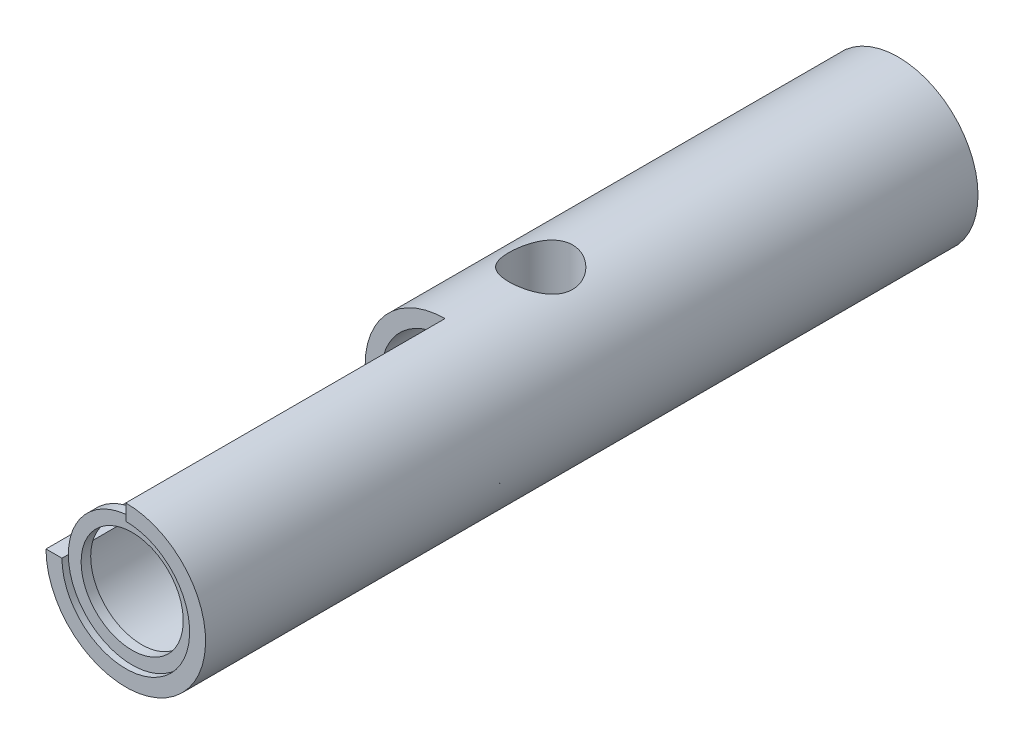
from build123d import *

# Parameters (mm, degrees)
ESQUISSE1_R                  = 12.5
BASE_EXTRUSION_DEPTH         = 121
ESQUISSE2_R                  = 10
ENL_V_MAT_EXTRU_1_DEPTH      = 58
ESQUISSE3_R                  = 4
ENL_V_MAT_EXTRU_2_DEPTH      = 66.433172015
ENL_V_MAT_EXTRU_3_DEPTH      = 15
ENL_V_MAT_EXTRU_3_DEPTH_BACK = 8
ESQUISSE4_R                  = 5
ESQUISSE5_R                  = 3
ENL_V_MAT_EXTRU_4_DEPTH      = 124.35923164
ESQUISSE9_W                  = 55
ESQUISSE9_H                  = 32.337681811
ENL_V_MAT_EXTRU_6_DEPTH      = 123.284504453
ESQUISSE6_W                  = 1.5
ESQUISSE6_H                  = 2


with BuildPart() as part:
    # Esquisse1 → Base-Extrusion (new body)
    with BuildSketch(Plane.XY):
        with Locations(Location((0, 0, 0), (0, 0, 180))):
            Circle(ESQUISSE1_R)
    extrude(amount=BASE_EXTRUSION_DEPTH)

    # Esquisse2 → Enl_v. mat.-Extru.1 (cut)
    with BuildSketch(Plane.XY.offset(121)):
        Circle(ESQUISSE2_R)
    extrude(amount=-ENL_V_MAT_EXTRU_1_DEPTH, mode=Mode.SUBTRACT)

    # Esquisse3 → Enl_v. mat.-Extru.2 (cut, through all)
    with BuildSketch(Plane.XY.offset(63)):
        Circle(ESQUISSE3_R)
    extrude(amount=-ENL_V_MAT_EXTRU_2_DEPTH, mode=Mode.SUBTRACT)

    # Esquisse4 → Enl_v. mat.-Extru.3 (cut, two sides: drawn at the far end of the back side and taken through both)
    with BuildSketch(Plane(origin=(0, 0, 0), x_dir=(-1, 0, 0), z_dir=(0, 1, 0)).offset(-ENL_V_MAT_EXTRU_3_DEPTH_BACK)):
        with Locations(Location((0, 56, 0), (0, 0, 90))):
            Circle(ESQUISSE4_R)
    extrude(amount=ENL_V_MAT_EXTRU_3_DEPTH + ENL_V_MAT_EXTRU_3_DEPTH_BACK, mode=Mode.SUBTRACT)

    # Esquisse5 → Enl_v. mat.-Extru.4 (cut, through all)
    with BuildSketch(Plane(origin=(0, -8, 0), x_dir=(-1, 0, 0), z_dir=(0, 1, 0))):
        with Locations(Location((0, 56, 0), (0, 0, 90))):
            Circle(ESQUISSE5_R)
    extrude(amount=-ENL_V_MAT_EXTRU_4_DEPTH, mode=Mode.SUBTRACT)

    # Esquisse9 → Enl_v. mat.-Extru.6 (cut, through all)
    with BuildSketch(Plane(origin=(0, 0, 0), x_dir=(0, 0, -1), z_dir=(1, 0, 0))):
        with Locations((-98.5, 16.168840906)):
            Rectangle(ESQUISSE9_W, ESQUISSE9_H)
    extrude(amount=-ENL_V_MAT_EXTRU_6_DEPTH, mode=Mode.SUBTRACT)

    # Esquisse6 → Anneau _lastique (revolve)
    with BuildSketch(Plane(origin=(0, 0, 0), x_dir=(0, 0, -1), z_dir=(1, 0, 0)), mode=Mode.PRIVATE) as anneau_lastique_sk:
        with Locations((-119.25, 9)):
            Rectangle(ESQUISSE6_W, ESQUISSE6_H)
    revolve(anneau_lastique_sk.sketch.rotate(Axis((0, 0, -6.276986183), (0, 0, 1)), 270), axis=Axis((0, 0, -6.276986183), (0, 0, 1)))


solid = part.part
